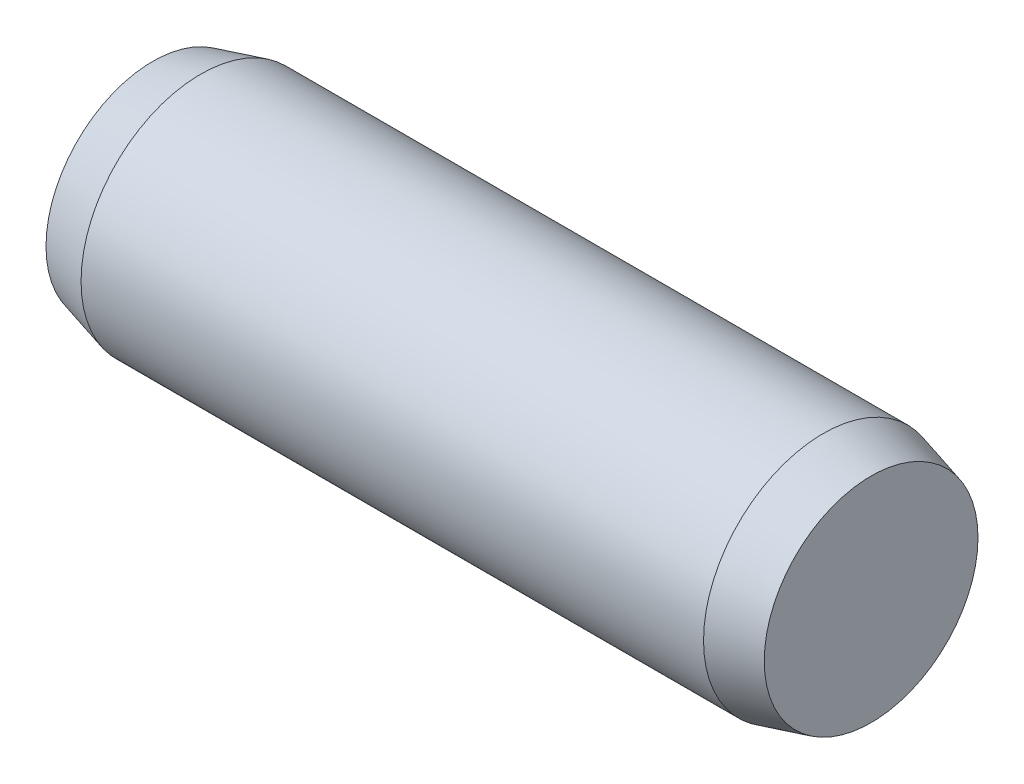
ISO-10303-21;
HEADER;
FILE_DESCRIPTION(('STEP AP214'),'2;1');
FILE_NAME('part.step','',(''),(''),'','','');
FILE_SCHEMA(('AUTOMOTIVE_DESIGN { 1 0 10303 214 1 1 1 1 }'));
ENDSEC;
DATA;
#1=APPLICATION_CONTEXT('core data for automotive mechanical design processes');
#2=APPLICATION_PROTOCOL_DEFINITION('international standard','automotive_design',2000,#1);
#3=PRODUCT_CONTEXT('',#1,'mechanical');
#4=PRODUCT('Part','Part','',(#3));
#5=PRODUCT_RELATED_PRODUCT_CATEGORY('part','',(#4));
#6=PRODUCT_DEFINITION_FORMATION('','',#4);
#7=PRODUCT_DEFINITION_CONTEXT('part definition',#1,'design');
#8=PRODUCT_DEFINITION('design','',#6,#7);
#9=PRODUCT_DEFINITION_SHAPE('','',#8);
#10=(LENGTH_UNIT() NAMED_UNIT(*) SI_UNIT(.MILLI.,.METRE.));
#11=(NAMED_UNIT(*) PLANE_ANGLE_UNIT() SI_UNIT($,.RADIAN.));
#12=(NAMED_UNIT(*) SI_UNIT($,.STERADIAN.) SOLID_ANGLE_UNIT());
#13=UNCERTAINTY_MEASURE_WITH_UNIT(LENGTH_MEASURE(1.E-05),#10,'distance_accuracy_value','');
#14=(GEOMETRIC_REPRESENTATION_CONTEXT(3) GLOBAL_UNCERTAINTY_ASSIGNED_CONTEXT((#13)) GLOBAL_UNIT_ASSIGNED_CONTEXT((#10,
#11,#12)) REPRESENTATION_CONTEXT('',''));
#15=CARTESIAN_POINT('',(0.,0.,0.));
#16=DIRECTION('',(0.,0.,1.));
#17=DIRECTION('',(1.,0.,0.));
#18=AXIS2_PLACEMENT_3D('',#15,#16,#17);
#19=CARTESIAN_POINT('',(0.,0.446410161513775,0.));
#20=DIRECTION('',(1.,0.,0.));
#21=DIRECTION('',(0.,0.,-1.));
#22=AXIS2_PLACEMENT_3D('',#19,#20,#21);
#23=PLANE('',#22);
#24=CARTESIAN_POINT('',(0.,0.,0.));
#25=DIRECTION('',(-1.,0.,0.));
#26=DIRECTION('',(0.,0.,1.));
#27=AXIS2_PLACEMENT_3D('',#24,#25,#26);
#28=CIRCLE('',#27,0.446410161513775);
#29=CARTESIAN_POINT('',(0.,0.,0.446410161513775));
#30=VERTEX_POINT('',#29);
#31=EDGE_CURVE('E45',#30,#30,#28,.T.);
#32=ORIENTED_EDGE('',*,*,#31,.T.);
#33=EDGE_LOOP('',(#32));
#34=FACE_BOUND('',#33,.T.);
#35=ADVANCED_FACE('F31',(#34),#23,.F.);
#36=CARTESIAN_POINT('',(3.,0.,0.));
#37=DIRECTION('',(-1.,0.,0.));
#38=DIRECTION('',(0.,0.,1.));
#39=AXIS2_PLACEMENT_3D('',#36,#37,#38);
#40=PLANE('',#39);
#41=CARTESIAN_POINT('',(3.,0.,0.));
#42=DIRECTION('',(-1.,0.,0.));
#43=DIRECTION('',(0.,0.,1.));
#44=AXIS2_PLACEMENT_3D('',#41,#42,#43);
#45=CIRCLE('',#44,0.446410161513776);
#46=CARTESIAN_POINT('',(3.,0.,0.446410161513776));
#47=VERTEX_POINT('',#46);
#48=EDGE_CURVE('E10',#47,#47,#45,.T.);
#49=ORIENTED_EDGE('',*,*,#48,.F.);
#50=EDGE_LOOP('',(#49));
#51=FACE_BOUND('',#50,.T.);
#52=ADVANCED_FACE('F65',(#51),#40,.F.);
#53=CARTESIAN_POINT('',(3.,0.,0.));
#54=DIRECTION('',(-1.,0.,0.));
#55=DIRECTION('',(0.,0.,1.));
#56=AXIS2_PLACEMENT_3D('',#53,#54,#55);
#57=CONICAL_SURFACE('',#56,0.446410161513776,0.261799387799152);
#58=CARTESIAN_POINT('',(2.8,0.,0.));
#59=DIRECTION('',(-1.,0.,0.));
#60=DIRECTION('',(0.,0.,1.));
#61=AXIS2_PLACEMENT_3D('',#58,#59,#60);
#62=CIRCLE('',#61,0.5);
#63=CARTESIAN_POINT('',(2.8,0.,0.5));
#64=VERTEX_POINT('',#63);
#65=EDGE_CURVE('E37',#64,#64,#62,.T.);
#66=ORIENTED_EDGE('',*,*,#65,.F.);
#67=EDGE_LOOP('',(#66));
#68=FACE_BOUND('',#67,.T.);
#69=ORIENTED_EDGE('',*,*,#48,.T.);
#70=EDGE_LOOP('',(#69));
#71=FACE_BOUND('',#70,.T.);
#72=ADVANCED_FACE('F60',(#68,#71),#57,.T.);
#73=CARTESIAN_POINT('',(-6.97668367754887,0.,0.));
#74=DIRECTION('',(-1.,0.,0.));
#75=DIRECTION('',(0.,0.,1.));
#76=AXIS2_PLACEMENT_3D('',#73,#74,#75);
#77=CYLINDRICAL_SURFACE('',#76,0.5);
#78=CARTESIAN_POINT('',(0.200000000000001,0.,0.));
#79=DIRECTION('',(-1.,0.,0.));
#80=DIRECTION('',(0.,0.,1.));
#81=AXIS2_PLACEMENT_3D('',#78,#79,#80);
#82=CIRCLE('',#81,0.5);
#83=CARTESIAN_POINT('',(0.200000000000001,0.,0.5));
#84=VERTEX_POINT('',#83);
#85=EDGE_CURVE('E41',#84,#84,#82,.T.);
#86=ORIENTED_EDGE('',*,*,#85,.F.);
#87=EDGE_LOOP('',(#86));
#88=FACE_BOUND('',#87,.T.);
#89=ORIENTED_EDGE('',*,*,#65,.T.);
#90=EDGE_LOOP('',(#89));
#91=FACE_BOUND('',#90,.T.);
#92=ADVANCED_FACE('F55',(#88,#91),#77,.T.);
#93=CARTESIAN_POINT('',(0.200000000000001,0.,0.));
#94=DIRECTION('',(1.,0.,0.));
#95=DIRECTION('',(0.,0.,-1.));
#96=AXIS2_PLACEMENT_3D('',#93,#94,#95);
#97=CONICAL_SURFACE('',#96,0.5,0.26179938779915);
#98=ORIENTED_EDGE('',*,*,#31,.F.);
#99=EDGE_LOOP('',(#98));
#100=FACE_BOUND('',#99,.T.);
#101=ORIENTED_EDGE('',*,*,#85,.T.);
#102=EDGE_LOOP('',(#101));
#103=FACE_BOUND('',#102,.T.);
#104=ADVANCED_FACE('F52',(#100,#103),#97,.T.);
#105=CLOSED_SHELL('',(#35,#52,#72,#92,#104));
#106=MANIFOLD_SOLID_BREP('B2',#105);
#107=ADVANCED_BREP_SHAPE_REPRESENTATION('',(#18,#106),#14);
#108=SHAPE_DEFINITION_REPRESENTATION(#9,#107);
ENDSEC;
END-ISO-10303-21;
